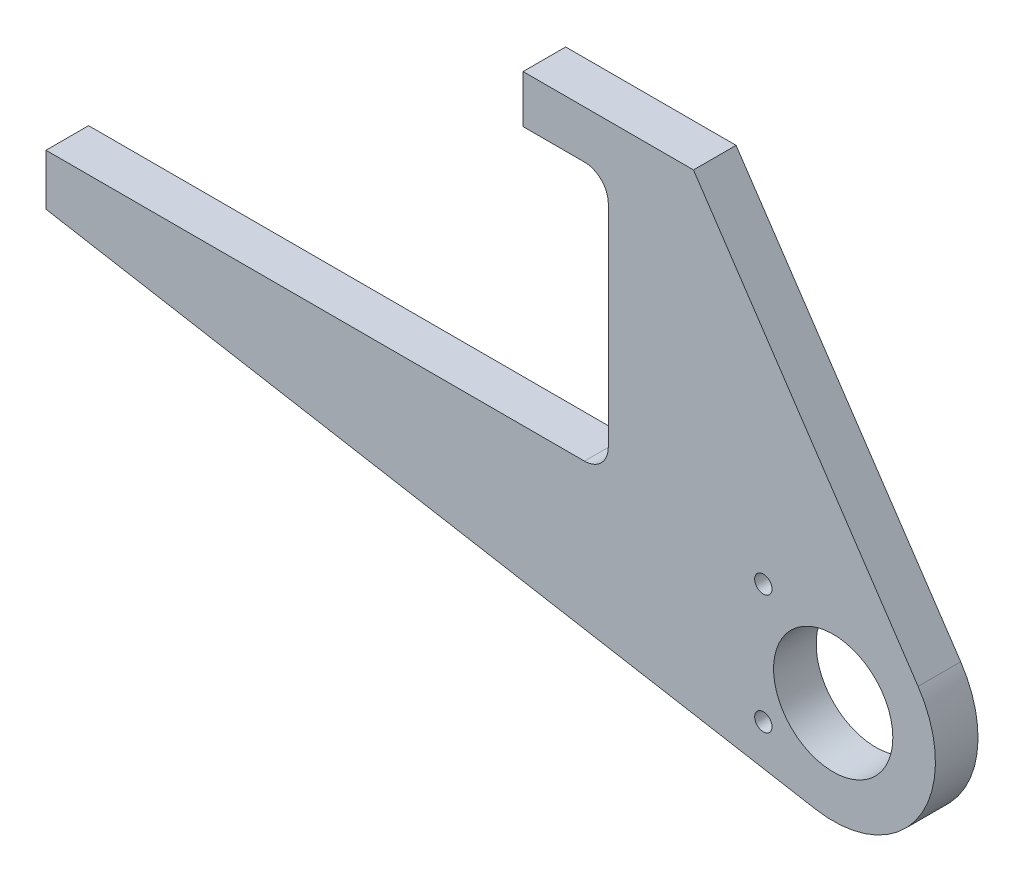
from build123d import *

# Parameters (mm, degrees)
ESQUISSE1_R            = 35
EXTRUSION1_DEPTH       = 25
TROU_TARAUD_M121_D     = 10.2
TROU_TARAUD_M121_DEPTH = 29.25
TROU_TARAUD_M121_TIP   = 3.064389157


with BuildPart() as part:
    # Esquisse1 → Extrusion1 (new body)
    with BuildSketch(Plane.XY):
        with BuildLine():
            Line((-462, 50), (-146, 50))
            ThreePointArc((-146, 50), (-136.100505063, 54.100505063), (-132, 64))
            Line((-132, 64), (-132, 188))
            ThreePointArc((-132, 188), (-136.100505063, 197.899494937), (-146, 202))
            Line((-146, 202), (-182, 202))
            Line((-182, 202), (-182, 230))
            Line((-182, 230), (-82, 230))
            Line((-82, 230), (49.831875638, 33.41832088))
            ThreePointArc((49.831875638, 33.41832088), (50.295351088, -32.716626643), (-10.350669, -59.100453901))
            Line((-10.350669, -59.100453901), (-462, 20))
            Line((-462, 20), (-462, 50))
        make_face()
        Circle(ESQUISSE1_R, mode=Mode.SUBTRACT)
    extrude(amount=EXTRUSION1_DEPTH)

    # Trou taraud_ M121
    with Locations(Plane.XY.offset(25)):
        with Locations((-41, 40), (-41, -30)):
            Hole(TROU_TARAUD_M121_D / 2, depth=TROU_TARAUD_M121_DEPTH)
            with Locations((0, 0, -(TROU_TARAUD_M121_DEPTH + TROU_TARAUD_M121_TIP / 2))):  # 118° drill point
                Cone(0, TROU_TARAUD_M121_D / 2, TROU_TARAUD_M121_TIP, mode=Mode.SUBTRACT)


solid = part.part
